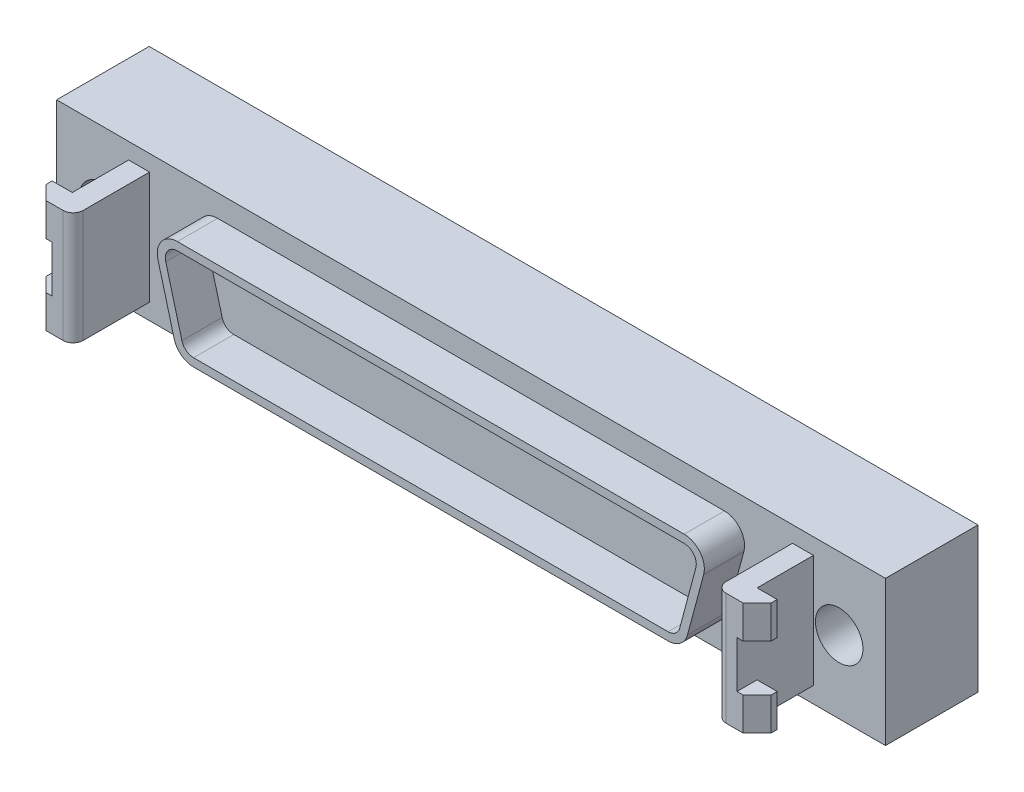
from build123d import *

# Parameters (mm, degrees)
BASE_OUTLINE_W       = 52.324
BASE_OUTLINE_H       = 9.144
BASE_OUTLINE_R       = 1.4986
CONNECTOR_BASE_DEPTH = 5.842
CONNECTOR_DEPTH      = 2.54
CLIP_DEPTH           = 3.556
CLIP_CUT_REACH       = 30.172
CUT_OUTLINE_W        = 1.27
CUT_OUTLINE_H        = 2.9464


with BuildPart() as part:
    # Base Outline → Connector Base (new body)
    with BuildSketch(Plane.XY):
        Rectangle(BASE_OUTLINE_W, BASE_OUTLINE_H)
        with Locations((-23.241, 0)):
            Circle(BASE_OUTLINE_R, mode=Mode.SUBTRACT)
        with Locations((23.241, 0)):
            Circle(BASE_OUTLINE_R, mode=Mode.SUBTRACT)
    extrude(amount=CONNECTOR_BASE_DEPTH)

    # Connector Outline → Connector (add)
    with BuildSketch(Plane.XY.offset(5.842)):
        with BuildLine():
            Line((17.224629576, 1.576299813), (16.203743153, -2.233700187))
            ThreePointArc((16.203743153, -2.233700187), (15.750144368, -2.912558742), (14.977017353, -3.175))
            Line((14.977017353, -3.175), (-14.977017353, -3.175))
            ThreePointArc((-14.977017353, -3.175), (-15.750144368, -2.912558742), (-16.203743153, -2.233700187))
            Line((-16.203743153, -2.233700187), (-17.224629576, 1.576299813))
            ThreePointArc((-17.224629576, 1.576299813), (-17.005462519, 2.678127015), (-15.997903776, 3.175))
            Line((-15.997903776, 3.175), (15.997903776, 3.175))
            ThreePointArc((15.997903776, 3.175), (17.005462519, 2.678127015), (17.224629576, 1.576299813))
        make_face()
        with BuildLine():
            Line((16.733939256, 1.707779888), (15.713052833, -2.102220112))
            ThreePointArc((15.713052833, -2.102220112), (15.440893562, -2.509535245), (14.977017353, -2.667))
            Line((14.977017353, -2.667), (-14.977017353, -2.667))
            ThreePointArc((-14.977017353, -2.667), (-15.440893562, -2.509535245), (-15.713052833, -2.102220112))
            Line((-15.713052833, -2.102220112), (-16.733939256, 1.707779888))
            ThreePointArc((-16.733939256, 1.707779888), (-16.602439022, 2.368876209), (-15.997903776, 2.667))
            Line((-15.997903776, 2.667), (15.997903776, 2.667))
            ThreePointArc((15.997903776, 2.667), (16.602439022, 2.368876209), (16.733939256, 1.707779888))
        make_face(mode=Mode.SUBTRACT)
    extrude(amount=CONNECTOR_DEPTH)

    # Clip Outline → Clip (add, symmetric)
    with BuildSketch(Plane(origin=(0, 0, 0), x_dir=(1, 0, 0), z_dir=(0, 1, 0))):
        with BuildLine():
            Line((-21.6154, -5.842), (-20.2946, -5.842))
            Line((-20.2946, -5.842), (-20.2946, -10.033))
            ThreePointArc((-20.2946, -10.033), (-20.480587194, -10.482012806), (-20.9296, -10.668))
            Line((-20.9296, -10.668), (-22.006907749, -10.668))
            Line((-22.006907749, -10.668), (-22.8854, -9.789507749))
            Line((-22.8854, -9.789507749), (-22.8854, -9.398))
            Line((-22.8854, -9.398), (-21.6154, -9.398))
            Line((-21.6154, -9.398), (-21.6154, -5.842))
        make_face()
    clip = extrude(amount=CLIP_DEPTH, both=True)

    # Cut Outline → Clip Cut (cut, up to next)
    with BuildSketch(Plane(origin=(0, 0, 9.398), x_dir=(-1, 0, 0), z_dir=(0, 0, -1)), mode=Mode.PRIVATE) as clip_cut_sk1:
        with Locations((22.2504, 0)):
            Rectangle(CUT_OUTLINE_W, CUT_OUTLINE_H)
    clip_cut_tool1 = extrude(clip_cut_sk1.sketch, amount=-CLIP_CUT_REACH, mode=Mode.PRIVATE) & part.part
    clip_cut = clip_cut_tool1.solids().sort_by_distance((-22.2504, 0, 9.398))[0]
    add(clip_cut, mode=Mode.SUBTRACT)

    # Clip Mirror: Clip, Clip Cut across plane
    add(clip.mirror(Plane(origin=(0, 0, 0), x_dir=(0, 0, 1), z_dir=(1, 0, 0))))
    add(clip_cut.mirror(Plane(origin=(0, 0, 0), x_dir=(0, 0, 1), z_dir=(1, 0, 0))), mode=Mode.SUBTRACT)


solid = part.part
